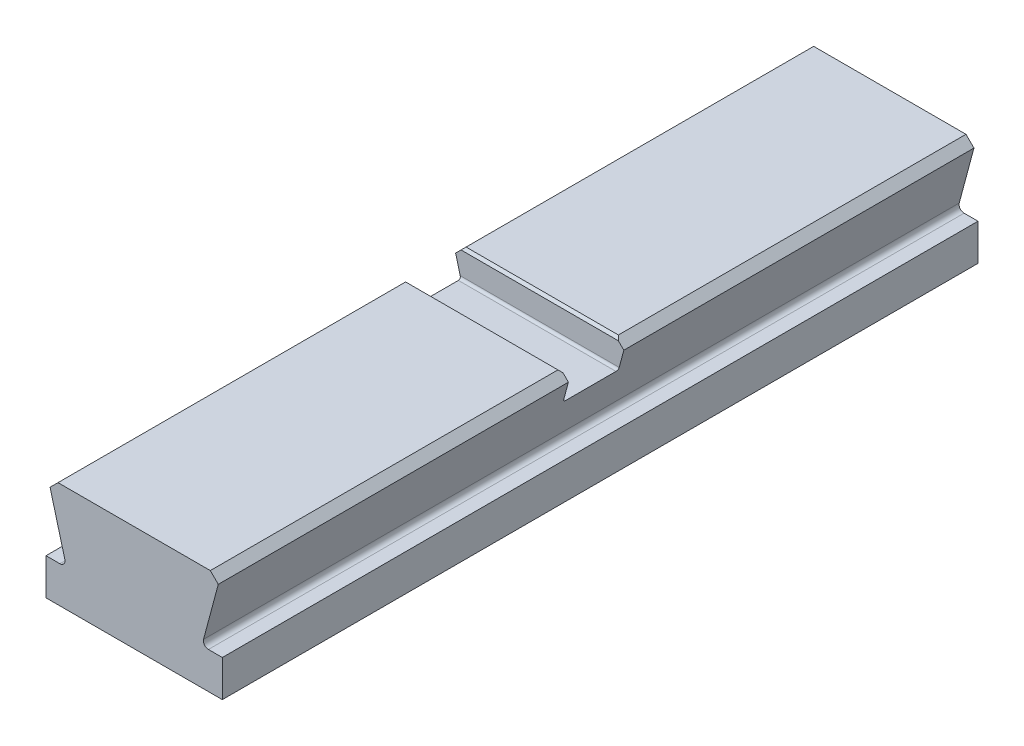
from build123d import *
from OCP.BRepFilletAPI import BRepFilletAPI_MakeChamfer

# Parameters (mm, degrees)
BOSS_EXTRU_1_DEPTH           = 150
BOSS_EXTRU_1_DEPTH_BACK      = 150
ENL_V_MAT_EXTRU_1_DEPTH      = 160.652748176
ENL_V_MAT_EXTRU_1_DEPTH_BACK = 160.652748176
ESQUISSE2_W                  = 22
ESQUISSE2_H                  = 11
CONG_1_R                     = 1
CHANFREIN1_SIZE              = 1
CONG_2_R                     = 2
CHANFREIN2_SIZE              = 4
CHANFREIN2_SIZE2             = 3.265986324


with BuildPart() as part:
    # Esquisse1 → Boss.-Extru.1 (new, two sides: drawn at the far end of the back side and taken through both)
    with BuildSketch(Plane.XY.offset(-BOSS_EXTRU_1_DEPTH_BACK)):
        Polygon((-34.234628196, 0), (34.234628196, 0), (26.866025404, -27.5), (35, -27.5), (35, -42), (-35, -42), (-35, -27.5), (-26.866025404, -27.5), align=None)
    extrude(amount=BOSS_EXTRU_1_DEPTH + BOSS_EXTRU_1_DEPTH_BACK)

    # Esquisse2 → Enl_v. mat.-Extru.1 (cut, two sides: drawn at the far end of the back side and taken through both)
    with BuildSketch(Plane(origin=(0, 0, 0), x_dir=(0, 0, -1), z_dir=(1, 0, 0)).offset(-ENL_V_MAT_EXTRU_1_DEPTH_BACK)):
        with Locations((0, -5.5)):
            Rectangle(ESQUISSE2_W, ESQUISSE2_H)
    extrude(amount=ENL_V_MAT_EXTRU_1_DEPTH + ENL_V_MAT_EXTRU_1_DEPTH_BACK, mode=Mode.SUBTRACT)

    # Cong_1
    cong_1_edges = [part.edges().sort_by_distance(p)[0] for p in [
        (0, -11, 11),
        (0, -11, -11),
    ]]
    fillet(cong_1_edges, radius=CONG_1_R)

    # Chanfrein1
    chanfrein1_edges = [part.edges().sort_by_distance(p)[0] for p in [
        (0, 0, 11),
        (0, 0, -11),
    ]]
    chamfer(chanfrein1_edges, length=CHANFREIN1_SIZE)

    # Cong_2
    cong_2_edges = [part.edges().sort_by_distance(p)[0] for p in [
        (26.866025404, -27.5, 0),
        (-26.866025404, -27.5, 0),
    ]]
    fillet(cong_2_edges, radius=CONG_2_R)

    # Chanfrein2: one chamfer whose edges measure the first distance from different faces: ONE call of the kernel's chamfer builder (chamfer() names one face for all edges)
    chanfrein2_edges_1 = [part.edges().sort_by_distance(p)[0] for p in [
        (34.234628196, 0, -81),
        (-34.234628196, 0, -81),
    ]]
    chanfrein2_side_1 = [part.faces().sort_by_distance(p)[0] for p in [
        (0, 0, -81),
    ]]
    chanfrein2_edges_2 = [part.edges().sort_by_distance(p)[0] for p in [
        (-34.234628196, 0, 81),
        (34.234628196, 0, 81),
    ]]
    chanfrein2_side_2 = [part.faces().sort_by_distance(p)[0] for p in [
        (0, 0, 81),
    ]]
    chanfrein2 = BRepFilletAPI_MakeChamfer(part.part.solid().wrapped)
    for e in chanfrein2_edges_1:
        chanfrein2.Add(CHANFREIN2_SIZE, CHANFREIN2_SIZE2, e.wrapped, chanfrein2_side_1[0].wrapped)  # the first distance lies on this face
    for e in chanfrein2_edges_2:
        chanfrein2.Add(CHANFREIN2_SIZE, CHANFREIN2_SIZE2, e.wrapped, chanfrein2_side_2[0].wrapped)  # the first distance lies on this face
    add(Compound.cast(chanfrein2.Shape()), mode=Mode.REPLACE)


solid = part.part
